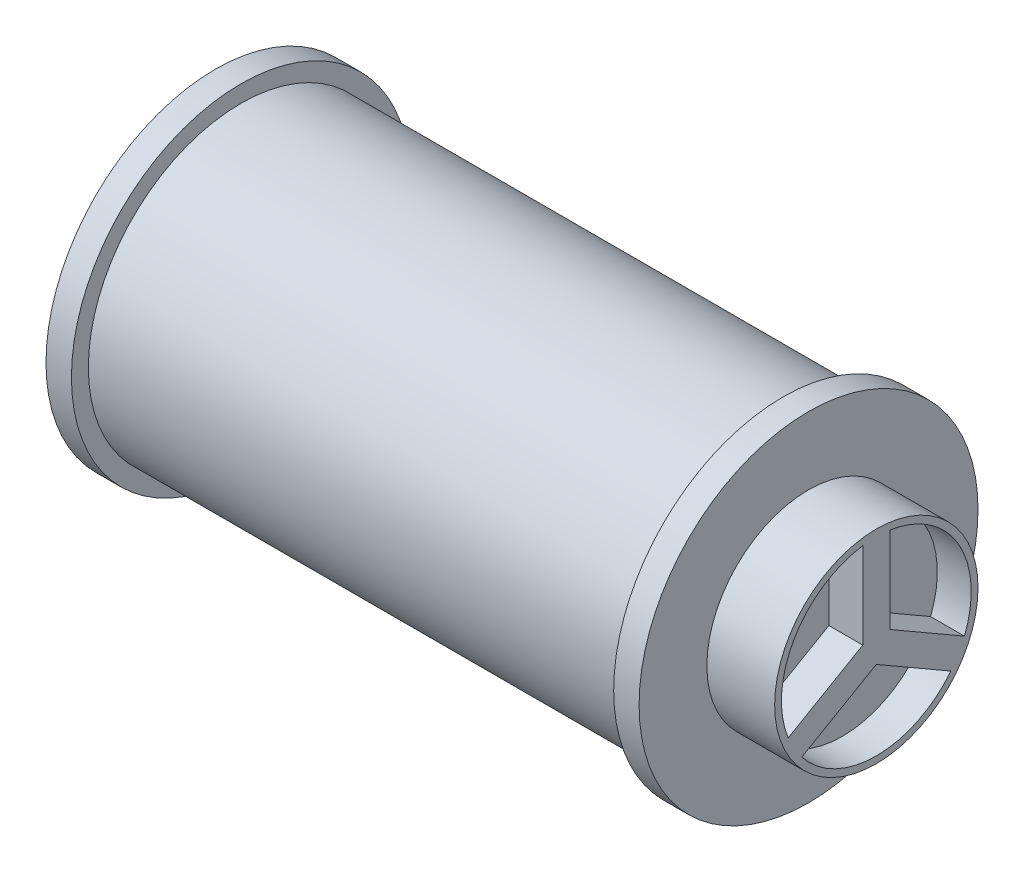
from build123d import *

# Parameters (mm, degrees)
ENL_V_MAT_EXTRU_1_DEPTH      = 1
R_P_TITION_CIRCULAIRE1_COUNT = 3


with BuildPart() as part:
    # Esquisse1 → R_volution1 (revolve)
    with BuildSketch(Plane.XY, mode=Mode.PRIVATE) as r_volution1_sk:
        Polygon((1, 5), (1.75, 5), (1.75, 4.5), (17.75, 4.5), (17.75, 5), (18.5, 5), (18.5, 3), (20.5, 3), (20.5, 0), (1, 0), align=None)
    revolve(r_volution1_sk.sketch.rotate(Axis((22.513311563, 0, 0), (-1, 0, 0)), 90), axis=Axis((22.513311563, 0, 0), (-1, 0, 0)))

    # Esquisse2 → Enl_v. mat.-Extru.1 (cut)
    with BuildSketch(Plane(origin=(20.5, 0, 0), x_dir=(0, 0, -1), z_dir=(1, 0, 0))):
        with BuildLine():
            Line((-0.4, 0.230940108), (-2.6, -1.039230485))
            ThreePointArc((-2.6, -1.039230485), (-2.424871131, 1.4), (-0.4, 2.771281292))
            Line((-0.4, 2.771281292), (-0.4, 0.230940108))
        make_face()
    enl_v_mat_extru_1 = extrude(amount=-ENL_V_MAT_EXTRU_1_DEPTH, mode=Mode.SUBTRACT)

    # R_p_tition circulaire1: Enl_v. mat.-Extru.1 ×3 about axis
    r_p_tition_circulaire1_axis = Axis((0, 0, 0), (1, 0, 0))
    for i in range(1, R_P_TITION_CIRCULAIRE1_COUNT):
        add(enl_v_mat_extru_1.rotate(r_p_tition_circulaire1_axis, i * 360 / R_P_TITION_CIRCULAIRE1_COUNT), mode=Mode.SUBTRACT)


solid = part.part
